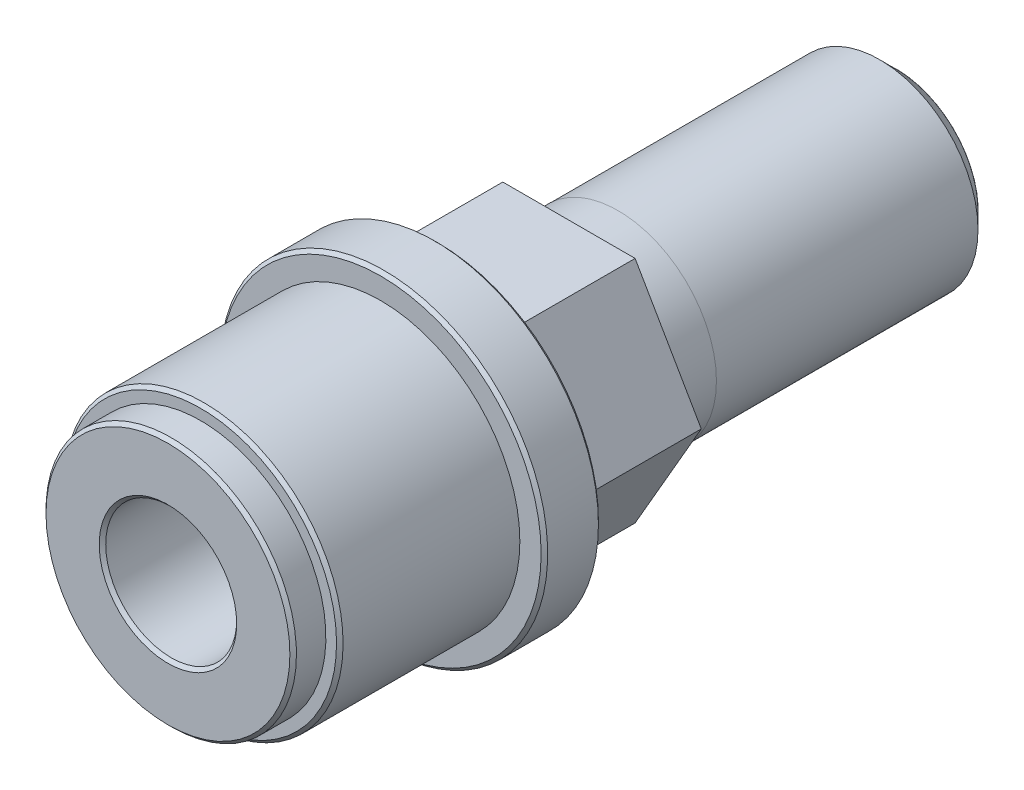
ISO-10303-21;
HEADER;
FILE_DESCRIPTION(('STEP AP214'),'2;1');
FILE_NAME('part.step','',(''),(''),'','','');
FILE_SCHEMA(('AUTOMOTIVE_DESIGN { 1 0 10303 214 1 1 1 1 }'));
ENDSEC;
DATA;
#1=APPLICATION_CONTEXT('core data for automotive mechanical design processes');
#2=APPLICATION_PROTOCOL_DEFINITION('international standard','automotive_design',2000,#1);
#3=PRODUCT_CONTEXT('',#1,'mechanical');
#4=PRODUCT('Part','Part','',(#3));
#5=PRODUCT_RELATED_PRODUCT_CATEGORY('part','',(#4));
#6=PRODUCT_DEFINITION_FORMATION('','',#4);
#7=PRODUCT_DEFINITION_CONTEXT('part definition',#1,'design');
#8=PRODUCT_DEFINITION('design','',#6,#7);
#9=PRODUCT_DEFINITION_SHAPE('','',#8);
#10=(LENGTH_UNIT() NAMED_UNIT(*) SI_UNIT(.MILLI.,.METRE.));
#11=(NAMED_UNIT(*) PLANE_ANGLE_UNIT() SI_UNIT($,.RADIAN.));
#12=(NAMED_UNIT(*) SI_UNIT($,.STERADIAN.) SOLID_ANGLE_UNIT());
#13=UNCERTAINTY_MEASURE_WITH_UNIT(LENGTH_MEASURE(1.E-05),#10,'distance_accuracy_value','');
#14=(GEOMETRIC_REPRESENTATION_CONTEXT(3) GLOBAL_UNCERTAINTY_ASSIGNED_CONTEXT((#13)) GLOBAL_UNIT_ASSIGNED_CONTEXT((#10,
#11,#12)) REPRESENTATION_CONTEXT('',''));
#15=CARTESIAN_POINT('',(0.,0.,0.));
#16=DIRECTION('',(0.,0.,1.));
#17=DIRECTION('',(1.,0.,0.));
#18=AXIS2_PLACEMENT_3D('',#15,#16,#17);
#19=CARTESIAN_POINT('',(0.,0.,32.6));
#20=DIRECTION('',(0.,0.,-1.));
#21=DIRECTION('',(0.997817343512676,0.0660344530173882,0.));
#22=AXIS2_PLACEMENT_3D('',#19,#20,#21);
#23=CONICAL_SURFACE('',#22,8.5,0.78539816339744);
#24=CARTESIAN_POINT('',(0.,0.,32.8));
#25=DIRECTION('',(0.,0.,1.));
#26=DIRECTION('',(-0.997817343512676,-0.0660344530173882,0.));
#27=AXIS2_PLACEMENT_3D('',#24,#25,#26);
#28=CIRCLE('',#27,8.3);
#29=CARTESIAN_POINT('',(-8.28188395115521,-0.548085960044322,32.8));
#30=VERTEX_POINT('',#29);
#31=EDGE_CURVE('E9',#30,#30,#28,.T.);
#32=ORIENTED_EDGE('',*,*,#31,.F.);
#33=EDGE_LOOP('',(#32));
#34=FACE_BOUND('',#33,.T.);
#35=CARTESIAN_POINT('',(0.,0.,32.6));
#36=DIRECTION('',(0.,0.,1.));
#37=DIRECTION('',(-0.997817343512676,-0.0660344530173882,0.));
#38=AXIS2_PLACEMENT_3D('',#35,#36,#37);
#39=CIRCLE('',#38,8.5);
#40=CARTESIAN_POINT('',(-8.48144741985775,-0.5612928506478,32.6));
#41=VERTEX_POINT('',#40);
#42=EDGE_CURVE('E23',#41,#41,#39,.F.);
#43=ORIENTED_EDGE('',*,*,#42,.F.);
#44=EDGE_LOOP('',(#43));
#45=FACE_BOUND('',#44,.T.);
#46=ADVANCED_FACE('F14',(#34,#45),#23,.T.);
#47=CARTESIAN_POINT('',(0.,0.,24.3));
#48=DIRECTION('',(0.,0.,-1.));
#49=DIRECTION('',(0.997817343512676,0.0660344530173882,0.));
#50=AXIS2_PLACEMENT_3D('',#47,#48,#49);
#51=CYLINDRICAL_SURFACE('',#50,8.5);
#52=ORIENTED_EDGE('',*,*,#42,.T.);
#53=EDGE_LOOP('',(#52));
#54=FACE_BOUND('',#53,.T.);
#55=CARTESIAN_POINT('',(0.,0.,21.8));
#56=DIRECTION('',(0.,0.,1.));
#57=DIRECTION('',(-1.,0.,0.));
#58=AXIS2_PLACEMENT_3D('',#55,#56,#57);
#59=CIRCLE('',#58,8.5);
#60=CARTESIAN_POINT('',(-8.5,0.,21.8));
#61=VERTEX_POINT('',#60);
#62=EDGE_CURVE('E146',#61,#61,#59,.T.);
#63=ORIENTED_EDGE('',*,*,#62,.T.);
#64=EDGE_LOOP('',(#63));
#65=FACE_BOUND('',#64,.T.);
#66=ADVANCED_FACE('F455',(#54,#65),#51,.T.);
#67=CARTESIAN_POINT('',(0.50516356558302,-7.63330267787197,32.8));
#68=DIRECTION('',(0.,0.,1.));
#69=DIRECTION('',(-0.997817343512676,-0.0660344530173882,0.));
#70=AXIS2_PLACEMENT_3D('',#67,#68,#69);
#71=PLANE('',#70);
#72=ORIENTED_EDGE('',*,*,#31,.T.);
#73=EDGE_LOOP('',(#72));
#74=FACE_BOUND('',#73,.T.);
#75=CARTESIAN_POINT('',(0.,0.,32.8));
#76=DIRECTION('',(0.,0.,-1.));
#77=DIRECTION('',(0.997817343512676,0.0660344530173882,0.));
#78=AXIS2_PLACEMENT_3D('',#75,#76,#77);
#79=CIRCLE('',#78,7.65);
#80=CARTESIAN_POINT('',(7.63330267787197,0.50516356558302,32.8));
#81=VERTEX_POINT('',#80);
#82=EDGE_CURVE('E130',#81,#81,#79,.T.);
#83=ORIENTED_EDGE('',*,*,#82,.T.);
#84=EDGE_LOOP('',(#83));
#85=FACE_BOUND('',#84,.T.);
#86=ADVANCED_FACE('F289',(#74,#85),#71,.T.);
#87=CARTESIAN_POINT('',(0.,0.,-9.69));
#88=DIRECTION('',(0.,0.,1.));
#89=DIRECTION('',(-1.,0.,0.));
#90=AXIS2_PLACEMENT_3D('',#87,#88,#89);
#91=CONICAL_SURFACE('',#90,5.,0.785398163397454);
#92=CARTESIAN_POINT('',(0.,0.,-8.69));
#93=DIRECTION('',(0.,0.,-1.));
#94=DIRECTION('',(1.,0.,0.));
#95=AXIS2_PLACEMENT_3D('',#92,#93,#94);
#96=CIRCLE('',#95,6.);
#97=CARTESIAN_POINT('',(6.,0.,-8.69));
#98=VERTEX_POINT('',#97);
#99=EDGE_CURVE('E99',#98,#98,#96,.T.);
#100=ORIENTED_EDGE('',*,*,#99,.T.);
#101=EDGE_LOOP('',(#100));
#102=FACE_BOUND('',#101,.T.);
#103=CARTESIAN_POINT('',(0.,0.,-9.69));
#104=DIRECTION('',(0.,0.,-1.));
#105=DIRECTION('',(1.,0.,0.));
#106=AXIS2_PLACEMENT_3D('',#103,#104,#105);
#107=CIRCLE('',#106,5.);
#108=CARTESIAN_POINT('',(5.,0.,-9.69));
#109=VERTEX_POINT('',#108);
#110=EDGE_CURVE('E96',#109,#109,#107,.T.);
#111=ORIENTED_EDGE('',*,*,#110,.F.);
#112=EDGE_LOOP('',(#111));
#113=FACE_BOUND('',#112,.T.);
#114=ADVANCED_FACE('F254',(#102,#113),#91,.T.);
#115=CARTESIAN_POINT('',(0.,0.,39.976972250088));
#116=DIRECTION('',(0.,0.,1.));
#117=DIRECTION('',(-1.,0.,0.));
#118=AXIS2_PLACEMENT_3D('',#115,#116,#117);
#119=CYLINDRICAL_SURFACE('',#118,5.);
#120=CARTESIAN_POINT('',(0.,0.,-9.699));
#121=DIRECTION('',(0.,0.,1.));
#122=DIRECTION('',(-1.,0.,0.));
#123=AXIS2_PLACEMENT_3D('',#120,#121,#122);
#124=CIRCLE('',#123,5.);
#125=CARTESIAN_POINT('',(-5.,0.,-9.699));
#126=VERTEX_POINT('',#125);
#127=EDGE_CURVE('E102',#126,#126,#124,.T.);
#128=ORIENTED_EDGE('',*,*,#127,.T.);
#129=EDGE_LOOP('',(#128));
#130=FACE_BOUND('',#129,.T.);
#131=ORIENTED_EDGE('',*,*,#110,.T.);
#132=EDGE_LOOP('',(#131));
#133=FACE_BOUND('',#132,.T.);
#134=ADVANCED_FACE('F269',(#130,#133),#119,.T.);
#135=CARTESIAN_POINT('',(0.,0.,-9.699));
#136=DIRECTION('',(0.,0.,1.));
#137=DIRECTION('',(-1.,0.,0.));
#138=AXIS2_PLACEMENT_3D('',#135,#136,#137);
#139=CONICAL_SURFACE('',#138,5.,0.78539816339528);
#140=CARTESIAN_POINT('',(0.,0.,-9.7));
#141=DIRECTION('',(0.,0.,1.));
#142=DIRECTION('',(-1.,0.,0.));
#143=AXIS2_PLACEMENT_3D('',#140,#141,#142);
#144=CIRCLE('',#143,4.999);
#145=CARTESIAN_POINT('',(-4.999,0.,-9.7));
#146=VERTEX_POINT('',#145);
#147=EDGE_CURVE('E105',#146,#146,#144,.F.);
#148=ORIENTED_EDGE('',*,*,#147,.F.);
#149=EDGE_LOOP('',(#148));
#150=FACE_BOUND('',#149,.T.);
#151=ORIENTED_EDGE('',*,*,#127,.F.);
#152=EDGE_LOOP('',(#151));
#153=FACE_BOUND('',#152,.T.);
#154=ADVANCED_FACE('F266',(#150,#153),#139,.T.);
#155=CARTESIAN_POINT('',(5.,0.,-9.7));
#156=DIRECTION('',(0.,0.,1.));
#157=DIRECTION('',(-1.,0.,0.));
#158=AXIS2_PLACEMENT_3D('',#155,#156,#157);
#159=PLANE('',#158);
#160=CARTESIAN_POINT('',(0.,0.,-9.7));
#161=DIRECTION('',(0.,0.,1.));
#162=DIRECTION('',(-1.,0.,0.));
#163=AXIS2_PLACEMENT_3D('',#160,#161,#162);
#164=CIRCLE('',#163,4.25);
#165=CARTESIAN_POINT('',(-4.25,0.,-9.7));
#166=VERTEX_POINT('',#165);
#167=EDGE_CURVE('E18',#166,#166,#164,.T.);
#168=ORIENTED_EDGE('',*,*,#167,.T.);
#169=EDGE_LOOP('',(#168));
#170=FACE_BOUND('',#169,.T.);
#171=ORIENTED_EDGE('',*,*,#147,.T.);
#172=EDGE_LOOP('',(#171));
#173=FACE_BOUND('',#172,.T.);
#174=ADVANCED_FACE('F226',(#170,#173),#159,.F.);
#175=CARTESIAN_POINT('',(0.,0.,29.7946490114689));
#176=DIRECTION('',(0.,0.,1.));
#177=DIRECTION('',(-1.,0.,0.));
#178=AXIS2_PLACEMENT_3D('',#175,#176,#177);
#179=CYLINDRICAL_SURFACE('',#178,4.25);
#180=ORIENTED_EDGE('',*,*,#167,.F.);
#181=EDGE_LOOP('',(#180));
#182=FACE_BOUND('',#181,.T.);
#183=CARTESIAN_POINT('',(0.,0.,18.6511));
#184=DIRECTION('',(0.,0.,1.));
#185=DIRECTION('',(-1.,0.,0.));
#186=AXIS2_PLACEMENT_3D('',#183,#184,#185);
#187=CIRCLE('',#186,4.25);
#188=CARTESIAN_POINT('',(-4.25,0.,18.6511));
#189=VERTEX_POINT('',#188);
#190=EDGE_CURVE('E143',#189,#189,#187,.F.);
#191=ORIENTED_EDGE('',*,*,#190,.F.);
#192=EDGE_LOOP('',(#191));
#193=FACE_BOUND('',#192,.T.);
#194=ADVANCED_FACE('F215',(#182,#193),#179,.F.);
#195=CARTESIAN_POINT('',(-1.7,0.,18.6511));
#196=DIRECTION('',(0.,0.,1.));
#197=DIRECTION('',(0.,1.,0.));
#198=AXIS2_PLACEMENT_3D('',#195,#196,#197);
#199=PLANE('',#198);
#200=ORIENTED_EDGE('',*,*,#190,.T.);
#201=EDGE_LOOP('',(#200));
#202=FACE_BOUND('',#201,.T.);
#203=CARTESIAN_POINT('',(0.,0.,18.6511));
#204=DIRECTION('',(0.,0.,1.));
#205=DIRECTION('',(-1.,0.,0.));
#206=AXIS2_PLACEMENT_3D('',#203,#204,#205);
#207=CIRCLE('',#206,4.);
#208=CARTESIAN_POINT('',(-4.,0.,18.6511));
#209=VERTEX_POINT('',#208);
#210=EDGE_CURVE('E140',#209,#209,#207,.F.);
#211=ORIENTED_EDGE('',*,*,#210,.F.);
#212=EDGE_LOOP('',(#211));
#213=FACE_BOUND('',#212,.T.);
#214=ADVANCED_FACE('F212',(#202,#213),#199,.F.);
#215=CARTESIAN_POINT('',(0.,0.,29.7946490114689));
#216=DIRECTION('',(0.,0.,1.));
#217=DIRECTION('',(-1.,0.,0.));
#218=AXIS2_PLACEMENT_3D('',#215,#216,#217);
#219=CYLINDRICAL_SURFACE('',#218,4.);
#220=ORIENTED_EDGE('',*,*,#210,.T.);
#221=EDGE_LOOP('',(#220));
#222=FACE_BOUND('',#221,.T.);
#223=CARTESIAN_POINT('',(0.,0.,34.6));
#224=DIRECTION('',(0.,0.,-1.));
#225=DIRECTION('',(1.,0.,0.));
#226=AXIS2_PLACEMENT_3D('',#223,#224,#225);
#227=CIRCLE('',#226,4.);
#228=CARTESIAN_POINT('',(4.,0.,34.6));
#229=VERTEX_POINT('',#228);
#230=EDGE_CURVE('E114',#229,#229,#227,.F.);
#231=ORIENTED_EDGE('',*,*,#230,.T.);
#232=EDGE_LOOP('',(#231));
#233=FACE_BOUND('',#232,.T.);
#234=ADVANCED_FACE('F214',(#222,#233),#219,.F.);
#235=CARTESIAN_POINT('',(0.,0.,34.6));
#236=DIRECTION('',(0.,0.,1.));
#237=DIRECTION('',(-1.,0.,0.));
#238=AXIS2_PLACEMENT_3D('',#235,#236,#237);
#239=CONICAL_SURFACE('',#238,4.,0.785398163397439);
#240=CARTESIAN_POINT('',(0.,0.,34.8));
#241=DIRECTION('',(0.,0.,-1.));
#242=DIRECTION('',(1.,0.,0.));
#243=AXIS2_PLACEMENT_3D('',#240,#241,#242);
#244=CIRCLE('',#243,4.2);
#245=CARTESIAN_POINT('',(4.2,0.,34.8));
#246=VERTEX_POINT('',#245);
#247=EDGE_CURVE('E117',#246,#246,#244,.T.);
#248=ORIENTED_EDGE('',*,*,#247,.F.);
#249=EDGE_LOOP('',(#248));
#250=FACE_BOUND('',#249,.T.);
#251=ORIENTED_EDGE('',*,*,#230,.F.);
#252=EDGE_LOOP('',(#251));
#253=FACE_BOUND('',#252,.T.);
#254=ADVANCED_FACE('F223',(#250,#253),#239,.F.);
#255=CARTESIAN_POINT('',(7.65,0.,34.8));
#256=DIRECTION('',(0.,0.,-1.));
#257=DIRECTION('',(1.,0.,0.));
#258=AXIS2_PLACEMENT_3D('',#255,#256,#257);
#259=PLANE('',#258);
#260=ORIENTED_EDGE('',*,*,#247,.T.);
#261=EDGE_LOOP('',(#260));
#262=FACE_BOUND('',#261,.T.);
#263=CARTESIAN_POINT('',(0.,0.,34.8));
#264=DIRECTION('',(0.,0.,-1.));
#265=DIRECTION('',(1.,0.,0.));
#266=AXIS2_PLACEMENT_3D('',#263,#264,#265);
#267=CIRCLE('',#266,7.45);
#268=CARTESIAN_POINT('',(7.45,0.,34.8));
#269=VERTEX_POINT('',#268);
#270=EDGE_CURVE('E108',#269,#269,#267,.F.);
#271=ORIENTED_EDGE('',*,*,#270,.T.);
#272=EDGE_LOOP('',(#271));
#273=FACE_BOUND('',#272,.T.);
#274=ADVANCED_FACE('F260',(#262,#273),#259,.F.);
#275=CARTESIAN_POINT('',(0.,0.,34.8));
#276=DIRECTION('',(0.,0.,-1.));
#277=DIRECTION('',(1.,0.,0.));
#278=AXIS2_PLACEMENT_3D('',#275,#276,#277);
#279=CONICAL_SURFACE('',#278,7.45,0.785398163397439);
#280=CARTESIAN_POINT('',(0.,0.,34.6));
#281=DIRECTION('',(0.,0.,-1.));
#282=DIRECTION('',(1.,0.,0.));
#283=AXIS2_PLACEMENT_3D('',#280,#281,#282);
#284=CIRCLE('',#283,7.65);
#285=CARTESIAN_POINT('',(7.65,0.,34.6));
#286=VERTEX_POINT('',#285);
#287=EDGE_CURVE('E111',#286,#286,#284,.T.);
#288=ORIENTED_EDGE('',*,*,#287,.F.);
#289=EDGE_LOOP('',(#288));
#290=FACE_BOUND('',#289,.T.);
#291=ORIENTED_EDGE('',*,*,#270,.F.);
#292=EDGE_LOOP('',(#291));
#293=FACE_BOUND('',#292,.T.);
#294=ADVANCED_FACE('F262',(#290,#293),#279,.T.);
#295=CARTESIAN_POINT('',(0.,0.,39.976972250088));
#296=DIRECTION('',(0.,0.,1.));
#297=DIRECTION('',(-1.,0.,0.));
#298=AXIS2_PLACEMENT_3D('',#295,#296,#297);
#299=CYLINDRICAL_SURFACE('',#298,7.65);
#300=ORIENTED_EDGE('',*,*,#82,.F.);
#301=EDGE_LOOP('',(#300));
#302=FACE_BOUND('',#301,.T.);
#303=ORIENTED_EDGE('',*,*,#287,.T.);
#304=EDGE_LOOP('',(#303));
#305=FACE_BOUND('',#304,.T.);
#306=ADVANCED_FACE('F209',(#302,#305),#299,.T.);
#307=CARTESIAN_POINT('',(0.,0.,2.8));
#308=DIRECTION('',(0.,0.,-1.));
#309=DIRECTION('',(1.,0.,0.));
#310=AXIS2_PLACEMENT_3D('',#307,#308,#309);
#311=CYLINDRICAL_SURFACE('',#310,6.);
#312=ORIENTED_EDGE('',*,*,#99,.F.);
#313=EDGE_LOOP('',(#312));
#314=FACE_BOUND('',#313,.T.);
#315=CARTESIAN_POINT('',(0.,0.,7.3));
#316=DIRECTION('',(0.,0.,-1.));
#317=DIRECTION('',(1.,0.,0.));
#318=AXIS2_PLACEMENT_3D('',#315,#316,#317);
#319=CIRCLE('',#318,6.);
#320=CARTESIAN_POINT('',(6.,0.,7.3));
#321=VERTEX_POINT('',#320);
#322=EDGE_CURVE('E155',#321,#321,#319,.T.);
#323=ORIENTED_EDGE('',*,*,#322,.T.);
#324=EDGE_LOOP('',(#323));
#325=FACE_BOUND('',#324,.T.);
#326=ADVANCED_FACE('F208',(#314,#325),#311,.T.);
#327=CARTESIAN_POINT('',(-6.,0.,7.3));
#328=DIRECTION('',(0.,0.,1.));
#329=DIRECTION('',(-1.,0.,0.));
#330=AXIS2_PLACEMENT_3D('',#327,#328,#329);
#331=PLANE('',#330);
#332=ORIENTED_EDGE('',*,*,#322,.F.);
#333=EDGE_LOOP('',(#332));
#334=FACE_BOUND('',#333,.T.);
#335=CARTESIAN_POINT('',(0.,0.,7.3));
#336=DIRECTION('',(0.,0.,-1.));
#337=DIRECTION('',(1.,0.,0.));
#338=AXIS2_PLACEMENT_3D('',#335,#336,#337);
#339=CIRCLE('',#338,6.01);
#340=CARTESIAN_POINT('',(6.01,0.,7.3));
#341=VERTEX_POINT('',#340);
#342=EDGE_CURVE('E152',#341,#341,#339,.T.);
#343=ORIENTED_EDGE('',*,*,#342,.T.);
#344=EDGE_LOOP('',(#343));
#345=FACE_BOUND('',#344,.T.);
#346=ADVANCED_FACE('F285',(#334,#345),#331,.F.);
#347=CARTESIAN_POINT('',(0.,0.,2.8));
#348=DIRECTION('',(0.,0.,-1.));
#349=DIRECTION('',(1.,0.,0.));
#350=AXIS2_PLACEMENT_3D('',#347,#348,#349);
#351=CYLINDRICAL_SURFACE('',#350,6.01);
#352=ORIENTED_EDGE('',*,*,#342,.F.);
#353=EDGE_LOOP('',(#352));
#354=FACE_BOUND('',#353,.T.);
#355=CARTESIAN_POINT('',(0.,0.,10.3));
#356=DIRECTION('',(0.,0.,-1.));
#357=DIRECTION('',(1.,0.,0.));
#358=AXIS2_PLACEMENT_3D('',#355,#356,#357);
#359=CIRCLE('',#358,6.01);
#360=CARTESIAN_POINT('',(6.01,0.,10.3));
#361=VERTEX_POINT('',#360);
#362=EDGE_CURVE('E149',#361,#361,#359,.T.);
#363=ORIENTED_EDGE('',*,*,#362,.T.);
#364=EDGE_LOOP('',(#363));
#365=FACE_BOUND('',#364,.T.);
#366=ADVANCED_FACE('F205',(#354,#365),#351,.T.);
#367=CARTESIAN_POINT('',(-8.5,0.,10.3));
#368=DIRECTION('',(0.,0.,-1.));
#369=DIRECTION('',(1.,0.,0.));
#370=AXIS2_PLACEMENT_3D('',#367,#368,#369);
#371=PLANE('',#370);
#372=ORIENTED_EDGE('',*,*,#362,.F.);
#373=EDGE_LOOP('',(#372));
#374=FACE_BOUND('',#373,.T.);
#375=DIRECTION('',(0.5,-0.866025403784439,0.));
#376=VECTOR('',#375,1.);
#377=CARTESIAN_POINT('',(4.04145188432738,7.,10.3));
#378=LINE('',#377,#376);
#379=CARTESIAN_POINT('',(4.04145188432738,7.,10.3));
#380=VERTEX_POINT('',#379);
#381=CARTESIAN_POINT('',(8.08290376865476,0.,10.3));
#382=VERTEX_POINT('',#381);
#383=EDGE_CURVE('E158',#380,#382,#378,.T.);
#384=ORIENTED_EDGE('',*,*,#383,.T.);
#385=DIRECTION('',(-0.5,-0.866025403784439,0.));
#386=VECTOR('',#385,1.);
#387=CARTESIAN_POINT('',(8.08290376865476,0.,10.3));
#388=LINE('',#387,#386);
#389=CARTESIAN_POINT('',(4.04145188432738,-7.,10.3));
#390=VERTEX_POINT('',#389);
#391=EDGE_CURVE('E31',#382,#390,#388,.T.);
#392=ORIENTED_EDGE('',*,*,#391,.T.);
#393=DIRECTION('',(-1.,0.,0.));
#394=VECTOR('',#393,1.);
#395=CARTESIAN_POINT('',(4.04145188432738,-7.,10.3));
#396=LINE('',#395,#394);
#397=CARTESIAN_POINT('',(-4.04145188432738,-7.,10.3));
#398=VERTEX_POINT('',#397);
#399=EDGE_CURVE('E165',#390,#398,#396,.T.);
#400=ORIENTED_EDGE('',*,*,#399,.T.);
#401=DIRECTION('',(-0.5,0.866025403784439,0.));
#402=VECTOR('',#401,1.);
#403=CARTESIAN_POINT('',(-4.04145188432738,-7.,10.3));
#404=LINE('',#403,#402);
#405=CARTESIAN_POINT('',(-8.08290376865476,0.,10.3));
#406=VERTEX_POINT('',#405);
#407=EDGE_CURVE('E168',#398,#406,#404,.T.);
#408=ORIENTED_EDGE('',*,*,#407,.T.);
#409=DIRECTION('',(0.5,0.866025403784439,0.));
#410=VECTOR('',#409,1.);
#411=CARTESIAN_POINT('',(-8.08290376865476,0.,10.3));
#412=LINE('',#411,#410);
#413=CARTESIAN_POINT('',(-4.04145188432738,7.,10.3));
#414=VERTEX_POINT('',#413);
#415=EDGE_CURVE('E79',#406,#414,#412,.T.);
#416=ORIENTED_EDGE('',*,*,#415,.T.);
#417=DIRECTION('',(1.,0.,0.));
#418=VECTOR('',#417,1.);
#419=CARTESIAN_POINT('',(-4.04145188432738,7.,10.3));
#420=LINE('',#419,#418);
#421=EDGE_CURVE('E92',#414,#380,#420,.T.);
#422=ORIENTED_EDGE('',*,*,#421,.T.);
#423=EDGE_LOOP('',(#384,#392,#400,#408,#416,#422));
#424=FACE_BOUND('',#423,.T.);
#425=ADVANCED_FACE('F184',(#374,#424),#371,.T.);
#426=CARTESIAN_POINT('',(4.04145188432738,-7.,42.582046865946));
#427=DIRECTION('',(0.,-1.,0.));
#428=DIRECTION('',(0.,0.,1.));
#429=AXIS2_PLACEMENT_3D('',#426,#427,#428);
#430=PLANE('',#429);
#431=DIRECTION('',(0.,0.,-1.));
#432=VECTOR('',#431,1.);
#433=CARTESIAN_POINT('',(-4.04145188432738,-7.,42.582046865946));
#434=LINE('',#433,#432);
#435=CARTESIAN_POINT('',(-4.04145188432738,-7.,18.3));
#436=VERTEX_POINT('',#435);
#437=EDGE_CURVE('E75',#436,#398,#434,.T.);
#438=ORIENTED_EDGE('',*,*,#437,.T.);
#439=ORIENTED_EDGE('',*,*,#399,.F.);
#440=DIRECTION('',(0.,0.,-1.));
#441=VECTOR('',#440,1.);
#442=CARTESIAN_POINT('',(4.04145188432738,-7.,42.582046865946));
#443=LINE('',#442,#441);
#444=CARTESIAN_POINT('',(4.04145188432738,-7.,18.3));
#445=VERTEX_POINT('',#444);
#446=EDGE_CURVE('E85',#445,#390,#443,.T.);
#447=ORIENTED_EDGE('',*,*,#446,.F.);
#448=DIRECTION('',(1.,0.,0.));
#449=VECTOR('',#448,1.);
#450=CARTESIAN_POINT('',(4.04145188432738,-7.,18.3));
#451=LINE('',#450,#449);
#452=EDGE_CURVE('E40',#436,#445,#451,.T.);
#453=ORIENTED_EDGE('',*,*,#452,.F.);
#454=EDGE_LOOP('',(#438,#439,#447,#453));
#455=FACE_BOUND('',#454,.T.);
#456=ADVANCED_FACE('F195',(#455),#430,.T.);
#457=CARTESIAN_POINT('',(-4.04145188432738,-7.,42.582046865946));
#458=DIRECTION('',(-0.866025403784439,-0.5,0.));
#459=DIRECTION('',(0.5,-0.866025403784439,0.));
#460=AXIS2_PLACEMENT_3D('',#457,#458,#459);
#461=PLANE('',#460);
#462=DIRECTION('',(0.,0.,-1.));
#463=VECTOR('',#462,1.);
#464=CARTESIAN_POINT('',(-8.08290376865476,0.,42.582046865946));
#465=LINE('',#464,#463);
#466=CARTESIAN_POINT('',(-8.08290376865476,0.,18.3));
#467=VERTEX_POINT('',#466);
#468=EDGE_CURVE('E72',#467,#406,#465,.T.);
#469=ORIENTED_EDGE('',*,*,#468,.T.);
#470=ORIENTED_EDGE('',*,*,#407,.F.);
#471=ORIENTED_EDGE('',*,*,#437,.F.);
#472=DIRECTION('',(0.5,-0.866025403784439,0.));
#473=VECTOR('',#472,1.);
#474=CARTESIAN_POINT('',(-4.04145188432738,-7.,18.3));
#475=LINE('',#474,#473);
#476=EDGE_CURVE('E58',#467,#436,#475,.T.);
#477=ORIENTED_EDGE('',*,*,#476,.F.);
#478=EDGE_LOOP('',(#469,#470,#471,#477));
#479=FACE_BOUND('',#478,.T.);
#480=ADVANCED_FACE('F69',(#479),#461,.T.);
#481=CARTESIAN_POINT('',(-8.08290376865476,0.,42.582046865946));
#482=DIRECTION('',(-0.866025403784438,0.5,0.));
#483=DIRECTION('',(-0.5,-0.866025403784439,0.));
#484=AXIS2_PLACEMENT_3D('',#481,#482,#483);
#485=PLANE('',#484);
#486=DIRECTION('',(0.,0.,-1.));
#487=VECTOR('',#486,1.);
#488=CARTESIAN_POINT('',(-4.04145188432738,7.,42.582046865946));
#489=LINE('',#488,#487);
#490=CARTESIAN_POINT('',(-4.04145188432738,7.,18.3));
#491=VERTEX_POINT('',#490);
#492=EDGE_CURVE('E81',#491,#414,#489,.T.);
#493=ORIENTED_EDGE('',*,*,#492,.T.);
#494=ORIENTED_EDGE('',*,*,#415,.F.);
#495=ORIENTED_EDGE('',*,*,#468,.F.);
#496=DIRECTION('',(-0.5,-0.866025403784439,0.));
#497=VECTOR('',#496,1.);
#498=CARTESIAN_POINT('',(-8.08290376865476,0.,18.3));
#499=LINE('',#498,#497);
#500=EDGE_CURVE('E55',#491,#467,#499,.T.);
#501=ORIENTED_EDGE('',*,*,#500,.F.);
#502=EDGE_LOOP('',(#493,#494,#495,#501));
#503=FACE_BOUND('',#502,.T.);
#504=ADVANCED_FACE('F77',(#503),#485,.T.);
#505=CARTESIAN_POINT('',(-4.04145188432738,7.,42.582046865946));
#506=DIRECTION('',(0.,1.,0.));
#507=DIRECTION('',(0.,0.,-1.));
#508=AXIS2_PLACEMENT_3D('',#505,#506,#507);
#509=PLANE('',#508);
#510=DIRECTION('',(0.,0.,-1.));
#511=VECTOR('',#510,1.);
#512=CARTESIAN_POINT('',(4.04145188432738,7.,42.582046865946));
#513=LINE('',#512,#511);
#514=CARTESIAN_POINT('',(4.04145188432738,7.,18.3));
#515=VERTEX_POINT('',#514);
#516=EDGE_CURVE('E83',#515,#380,#513,.T.);
#517=ORIENTED_EDGE('',*,*,#516,.T.);
#518=ORIENTED_EDGE('',*,*,#421,.F.);
#519=ORIENTED_EDGE('',*,*,#492,.F.);
#520=DIRECTION('',(-1.,0.,0.));
#521=VECTOR('',#520,1.);
#522=CARTESIAN_POINT('',(-4.04145188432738,7.,18.3));
#523=LINE('',#522,#521);
#524=EDGE_CURVE('E60',#515,#491,#523,.T.);
#525=ORIENTED_EDGE('',*,*,#524,.F.);
#526=EDGE_LOOP('',(#517,#518,#519,#525));
#527=FACE_BOUND('',#526,.T.);
#528=ADVANCED_FACE('F178',(#527),#509,.T.);
#529=CARTESIAN_POINT('',(4.04145188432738,7.,42.582046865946));
#530=DIRECTION('',(0.866025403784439,0.5,0.));
#531=DIRECTION('',(-0.5,0.866025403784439,0.));
#532=AXIS2_PLACEMENT_3D('',#529,#530,#531);
#533=PLANE('',#532);
#534=DIRECTION('',(0.,0.,-1.));
#535=VECTOR('',#534,1.);
#536=CARTESIAN_POINT('',(8.08290376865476,0.,42.582046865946));
#537=LINE('',#536,#535);
#538=CARTESIAN_POINT('',(8.08290376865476,0.,18.3));
#539=VERTEX_POINT('',#538);
#540=EDGE_CURVE('E90',#539,#382,#537,.T.);
#541=ORIENTED_EDGE('',*,*,#540,.T.);
#542=ORIENTED_EDGE('',*,*,#383,.F.);
#543=ORIENTED_EDGE('',*,*,#516,.F.);
#544=DIRECTION('',(-0.5,0.866025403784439,0.));
#545=VECTOR('',#544,1.);
#546=CARTESIAN_POINT('',(4.04145188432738,7.,18.3));
#547=LINE('',#546,#545);
#548=EDGE_CURVE('E95',#539,#515,#547,.T.);
#549=ORIENTED_EDGE('',*,*,#548,.F.);
#550=EDGE_LOOP('',(#541,#542,#543,#549));
#551=FACE_BOUND('',#550,.T.);
#552=ADVANCED_FACE('F182',(#551),#533,.T.);
#553=CARTESIAN_POINT('',(8.08290376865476,0.,42.582046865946));
#554=DIRECTION('',(0.866025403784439,-0.5,0.));
#555=DIRECTION('',(0.5,0.866025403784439,0.));
#556=AXIS2_PLACEMENT_3D('',#553,#554,#555);
#557=PLANE('',#556);
#558=ORIENTED_EDGE('',*,*,#446,.T.);
#559=ORIENTED_EDGE('',*,*,#391,.F.);
#560=ORIENTED_EDGE('',*,*,#540,.F.);
#561=DIRECTION('',(0.5,0.866025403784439,0.));
#562=VECTOR('',#561,1.);
#563=CARTESIAN_POINT('',(8.08290376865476,0.,18.3));
#564=LINE('',#563,#562);
#565=EDGE_CURVE('E93',#445,#539,#564,.T.);
#566=ORIENTED_EDGE('',*,*,#565,.F.);
#567=EDGE_LOOP('',(#558,#559,#560,#566));
#568=FACE_BOUND('',#567,.T.);
#569=ADVANCED_FACE('F193',(#568),#557,.T.);
#570=CARTESIAN_POINT('',(7.65,0.,18.3));
#571=DIRECTION('',(0.,0.,-1.));
#572=DIRECTION('',(1.,0.,0.));
#573=AXIS2_PLACEMENT_3D('',#570,#571,#572);
#574=PLANE('',#573);
#575=CARTESIAN_POINT('',(0.,0.,18.3));
#576=DIRECTION('',(0.,0.,-1.));
#577=DIRECTION('',(1.,0.,0.));
#578=AXIS2_PLACEMENT_3D('',#575,#576,#577);
#579=CIRCLE('',#578,9.8);
#580=CARTESIAN_POINT('',(9.8,0.,18.3));
#581=VERTEX_POINT('',#580);
#582=EDGE_CURVE('E126',#581,#581,#579,.T.);
#583=ORIENTED_EDGE('',*,*,#582,.T.);
#584=EDGE_LOOP('',(#583));
#585=FACE_BOUND('',#584,.T.);
#586=ORIENTED_EDGE('',*,*,#565,.T.);
#587=ORIENTED_EDGE('',*,*,#548,.T.);
#588=ORIENTED_EDGE('',*,*,#524,.T.);
#589=ORIENTED_EDGE('',*,*,#500,.T.);
#590=ORIENTED_EDGE('',*,*,#476,.T.);
#591=ORIENTED_EDGE('',*,*,#452,.T.);
#592=EDGE_LOOP('',(#586,#587,#588,#589,#590,#591));
#593=FACE_BOUND('',#592,.T.);
#594=ADVANCED_FACE('F57',(#585,#593),#574,.T.);
#595=CARTESIAN_POINT('',(0.,0.,18.5));
#596=DIRECTION('',(0.,0.,1.));
#597=DIRECTION('',(-1.,0.,0.));
#598=AXIS2_PLACEMENT_3D('',#595,#596,#597);
#599=CONICAL_SURFACE('',#598,10.,0.785398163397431);
#600=ORIENTED_EDGE('',*,*,#582,.F.);
#601=EDGE_LOOP('',(#600));
#602=FACE_BOUND('',#601,.T.);
#603=CARTESIAN_POINT('',(0.,0.,18.5));
#604=DIRECTION('',(0.,0.,-1.));
#605=DIRECTION('',(1.,0.,0.));
#606=AXIS2_PLACEMENT_3D('',#603,#604,#605);
#607=CIRCLE('',#606,10.);
#608=CARTESIAN_POINT('',(10.,0.,18.5));
#609=VERTEX_POINT('',#608);
#610=EDGE_CURVE('E123',#609,#609,#607,.F.);
#611=ORIENTED_EDGE('',*,*,#610,.F.);
#612=EDGE_LOOP('',(#611));
#613=FACE_BOUND('',#612,.T.);
#614=ADVANCED_FACE('F236',(#602,#613),#599,.T.);
#615=CARTESIAN_POINT('',(0.,0.,2.8));
#616=DIRECTION('',(0.,0.,1.));
#617=DIRECTION('',(-1.,0.,0.));
#618=AXIS2_PLACEMENT_3D('',#615,#616,#617);
#619=CYLINDRICAL_SURFACE('',#618,10.);
#620=ORIENTED_EDGE('',*,*,#610,.T.);
#621=EDGE_LOOP('',(#620));
#622=FACE_BOUND('',#621,.T.);
#623=CARTESIAN_POINT('',(0.,0.,21.6));
#624=DIRECTION('',(0.,0.,1.));
#625=DIRECTION('',(-1.,0.,0.));
#626=AXIS2_PLACEMENT_3D('',#623,#624,#625);
#627=CIRCLE('',#626,10.);
#628=CARTESIAN_POINT('',(-10.,0.,21.6));
#629=VERTEX_POINT('',#628);
#630=EDGE_CURVE('E120',#629,#629,#627,.F.);
#631=ORIENTED_EDGE('',*,*,#630,.T.);
#632=EDGE_LOOP('',(#631));
#633=FACE_BOUND('',#632,.T.);
#634=ADVANCED_FACE('F234',(#622,#633),#619,.T.);
#635=CARTESIAN_POINT('',(0.,0.,21.8));
#636=DIRECTION('',(0.,0.,-1.));
#637=DIRECTION('',(1.,0.,0.));
#638=AXIS2_PLACEMENT_3D('',#635,#636,#637);
#639=CONICAL_SURFACE('',#638,9.8,0.785398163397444);
#640=ORIENTED_EDGE('',*,*,#630,.F.);
#641=EDGE_LOOP('',(#640));
#642=FACE_BOUND('',#641,.T.);
#643=CARTESIAN_POINT('',(0.,0.,21.8));
#644=DIRECTION('',(0.,0.,1.));
#645=DIRECTION('',(-1.,0.,0.));
#646=AXIS2_PLACEMENT_3D('',#643,#644,#645);
#647=CIRCLE('',#646,9.8);
#648=CARTESIAN_POINT('',(-9.8,0.,21.8));
#649=VERTEX_POINT('',#648);
#650=EDGE_CURVE('E128',#649,#649,#647,.T.);
#651=ORIENTED_EDGE('',*,*,#650,.F.);
#652=EDGE_LOOP('',(#651));
#653=FACE_BOUND('',#652,.T.);
#654=ADVANCED_FACE('F16',(#642,#653),#639,.T.);
#655=CARTESIAN_POINT('',(-8.5,0.,21.8));
#656=DIRECTION('',(0.,0.,1.));
#657=DIRECTION('',(-1.,0.,0.));
#658=AXIS2_PLACEMENT_3D('',#655,#656,#657);
#659=PLANE('',#658);
#660=ORIENTED_EDGE('',*,*,#650,.T.);
#661=EDGE_LOOP('',(#660));
#662=FACE_BOUND('',#661,.T.);
#663=ORIENTED_EDGE('',*,*,#62,.F.);
#664=EDGE_LOOP('',(#663));
#665=FACE_BOUND('',#664,.T.);
#666=ADVANCED_FACE('F233',(#662,#665),#659,.T.);
#667=CLOSED_SHELL('',(#46,#66,#86,#114,#134,#154,#174,#194,#214,#234,#254,#274,#294,#306,#326,
#346,#366,#425,#456,#480,#504,#528,#552,#569,#594,#614,#634,#654,#666));
#668=MANIFOLD_SOLID_BREP('B1',#667);
#669=ADVANCED_BREP_SHAPE_REPRESENTATION('',(#18,#668),#14);
#670=SHAPE_DEFINITION_REPRESENTATION(#9,#669);
ENDSEC;
END-ISO-10303-21;
